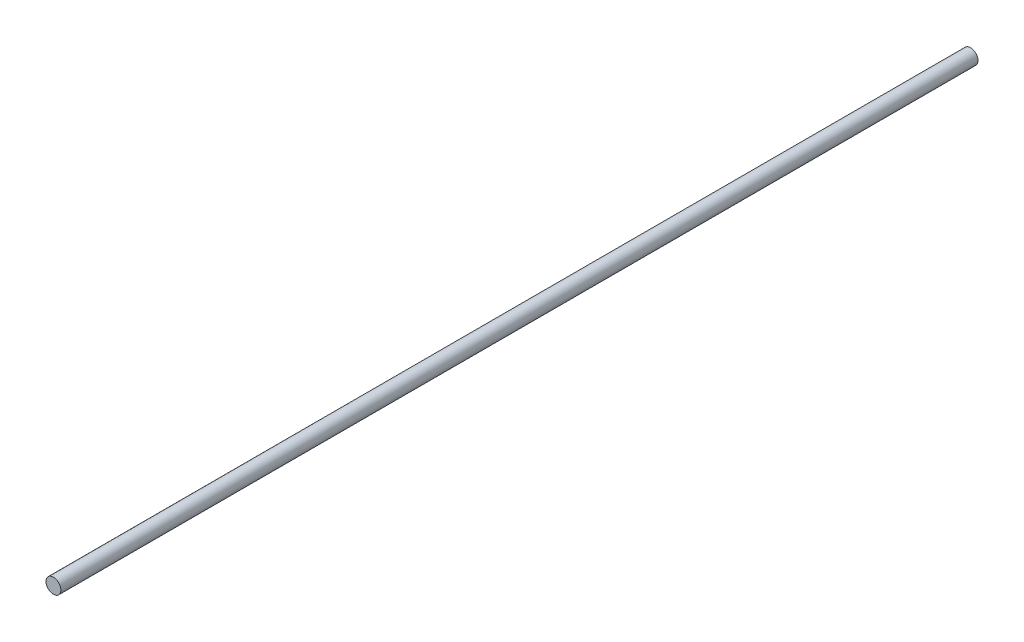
from build123d import *

# Parameters (mm, degrees)
SKETCH1_R           = 30
BOSS_EXTRUDE1_DEPTH = 3700


with BuildPart() as part:
    # Sketch1 → Boss-Extrude1 (new body)
    with BuildSketch(Plane.XY):
        Circle(SKETCH1_R)
    extrude(amount=-BOSS_EXTRUDE1_DEPTH)


solid = part.part
